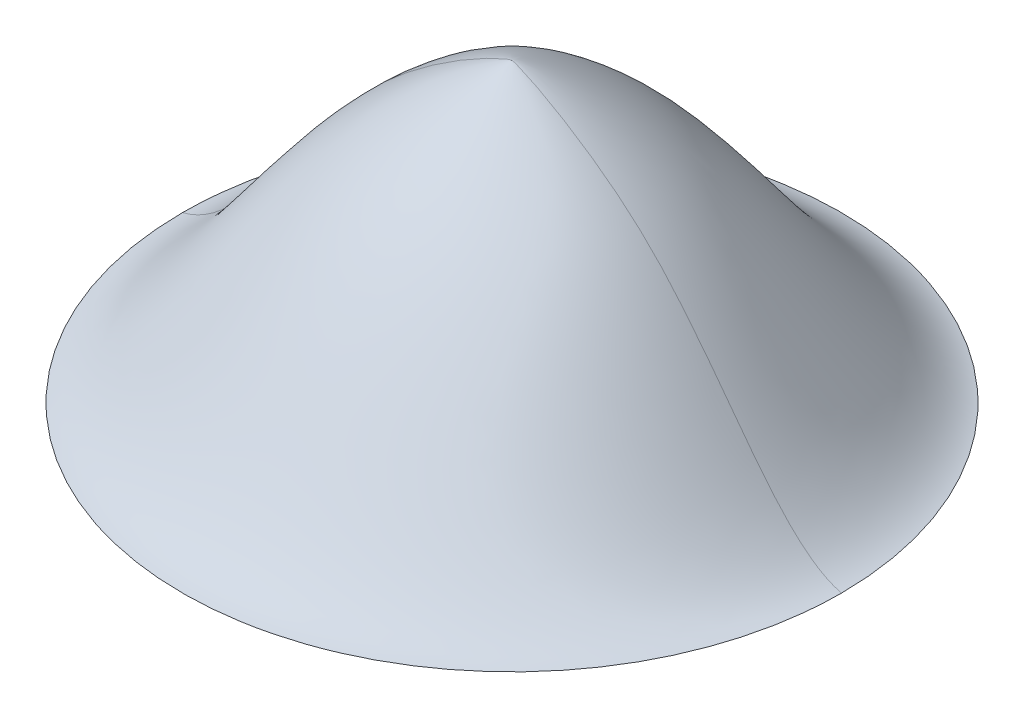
ISO-10303-21;
HEADER;
FILE_DESCRIPTION(('STEP AP214'),'2;1');
FILE_NAME('part.step','',(''),(''),'','','');
FILE_SCHEMA(('AUTOMOTIVE_DESIGN { 1 0 10303 214 1 1 1 1 }'));
ENDSEC;
DATA;
#1=APPLICATION_CONTEXT('core data for automotive mechanical design processes');
#2=APPLICATION_PROTOCOL_DEFINITION('international standard','automotive_design',2000,#1);
#3=PRODUCT_CONTEXT('',#1,'mechanical');
#4=PRODUCT('Part','Part','',(#3));
#5=PRODUCT_RELATED_PRODUCT_CATEGORY('part','',(#4));
#6=PRODUCT_DEFINITION_FORMATION('','',#4);
#7=PRODUCT_DEFINITION_CONTEXT('part definition',#1,'design');
#8=PRODUCT_DEFINITION('design','',#6,#7);
#9=PRODUCT_DEFINITION_SHAPE('','',#8);
#10=(LENGTH_UNIT() NAMED_UNIT(*) SI_UNIT(.MILLI.,.METRE.));
#11=(NAMED_UNIT(*) PLANE_ANGLE_UNIT() SI_UNIT($,.RADIAN.));
#12=(NAMED_UNIT(*) SI_UNIT($,.STERADIAN.) SOLID_ANGLE_UNIT());
#13=UNCERTAINTY_MEASURE_WITH_UNIT(LENGTH_MEASURE(1.E-05),#10,'distance_accuracy_value','');
#14=(GEOMETRIC_REPRESENTATION_CONTEXT(3) GLOBAL_UNCERTAINTY_ASSIGNED_CONTEXT((#13)) GLOBAL_UNIT_ASSIGNED_CONTEXT((#10,
#11,#12)) REPRESENTATION_CONTEXT('',''));
#15=CARTESIAN_POINT('',(0.,0.,0.));
#16=DIRECTION('',(0.,0.,1.));
#17=DIRECTION('',(1.,0.,0.));
#18=AXIS2_PLACEMENT_3D('',#15,#16,#17);
#19=CARTESIAN_POINT('',(-2.,0.,0.));
#20=CARTESIAN_POINT('',(-2.,0.,4.));
#21=CARTESIAN_POINT('',(2.,0.,4.));
#22=CARTESIAN_POINT('',(2.,0.,0.));
#23=CARTESIAN_POINT('',(-1.61118745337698,0.0939404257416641,0.));
#24=CARTESIAN_POINT('',(-1.61118745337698,0.0939404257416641,3.22237490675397));
#25=CARTESIAN_POINT('',(1.61118745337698,0.0939404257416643,3.22237490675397));
#26=CARTESIAN_POINT('',(1.61118745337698,0.0939404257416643,0.));
#27=CARTESIAN_POINT('',(-1.06164914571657,1.3113668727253,0.));
#28=CARTESIAN_POINT('',(-1.06164914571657,1.3113668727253,2.12329829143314));
#29=CARTESIAN_POINT('',(1.06164914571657,1.3113668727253,2.12329829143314));
#30=CARTESIAN_POINT('',(1.06164914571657,1.3113668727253,0.));
#31=CARTESIAN_POINT('',(-0.0421793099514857,1.8,0.));
#32=CARTESIAN_POINT('',(-0.0421793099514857,1.8,0.0843586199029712));
#33=CARTESIAN_POINT('',(0.0421793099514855,1.8,0.0843586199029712));
#34=CARTESIAN_POINT('',(0.0421793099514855,1.8,0.));
#35=CARTESIAN_POINT('',(0.,1.8,0.));
#36=CARTESIAN_POINT('',(0.,1.8,0.));
#37=CARTESIAN_POINT('',(0.,1.8,0.));
#38=CARTESIAN_POINT('',(0.,1.8,0.));
#39=(BOUNDED_SURFACE() B_SPLINE_SURFACE(3,3,((#19,#20,#21,#22),(#23,#24,#25,#26),(#27,#28,#29,
#30),(#31,#32,#33,#34),(#35,#36,#37,#38)),.UNSPECIFIED.,.F.,.F.,
.F.) B_SPLINE_SURFACE_WITH_KNOTS((4,1,4),(4,4),(0.,0.589485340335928,1.),(0.,1.),
.UNSPECIFIED.) GEOMETRIC_REPRESENTATION_ITEM() RATIONAL_B_SPLINE_SURFACE(((1.,0.333333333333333,
0.333333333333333,1.),(1.,0.333333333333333,0.333333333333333,1.),(1.,0.333333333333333,
0.333333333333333,1.),(1.,0.333333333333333,0.333333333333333,1.),(1.,0.333333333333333,
0.333333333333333,1.))) REPRESENTATION_ITEM('') SURFACE());
#40=CARTESIAN_POINT('',(-2.,0.,0.));
#41=CARTESIAN_POINT('',(-2.00000555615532,0.,0.0553011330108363));
#42=CARTESIAN_POINT('',(-1.99770654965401,0.,0.110601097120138));
#43=CARTESIAN_POINT('',(-1.98853137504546,0.,0.220921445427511));
#44=CARTESIAN_POINT('',(-1.98164689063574,0.,0.275941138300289));
#45=CARTESIAN_POINT('',(-1.96321385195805,0.,0.385930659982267));
#46=CARTESIAN_POINT('',(-1.95160578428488,0.,0.44089052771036));
#47=CARTESIAN_POINT('',(-1.92380855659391,0.,0.549646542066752));
#48=CARTESIAN_POINT('',(-1.90761873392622,0.,0.603442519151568));
#49=CARTESIAN_POINT('',(-1.87076149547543,0.,0.709509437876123));
#50=CARTESIAN_POINT('',(-1.85009205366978,0.,0.761779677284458));
#51=CARTESIAN_POINT('',(-1.80441836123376,0.,0.864428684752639));
#52=CARTESIAN_POINT('',(-1.77941041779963,0.,0.914805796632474));
#53=CARTESIAN_POINT('',(-1.69813109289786,0.,1.06252541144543));
#54=CARTESIAN_POINT('',(-1.63558652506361,0.,1.15650695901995));
#55=CARTESIAN_POINT('',(-1.49558805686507,0.,1.33261853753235));
#56=CARTESIAN_POINT('',(-1.41813372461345,0.,1.4147482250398));
#57=CARTESIAN_POINT('',(-1.29250560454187,0.,1.52728641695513));
#58=CARTESIAN_POINT('',(-1.24902259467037,0.,1.56304361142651));
#59=CARTESIAN_POINT('',(-1.15924585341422,0.,1.6307383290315));
#60=CARTESIAN_POINT('',(-1.11295486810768,0.,1.66267949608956));
#61=CARTESIAN_POINT('',(-0.9702522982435,0.,1.75248979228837));
#62=CARTESIAN_POINT('',(-0.869977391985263,0.,1.804375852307));
#63=CARTESIAN_POINT('',(-0.662192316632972,0.,1.89054714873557));
#64=CARTESIAN_POINT('',(-0.554682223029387,0.,1.9248325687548));
#65=CARTESIAN_POINT('',(-0.335417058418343,0.,1.97487553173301));
#66=CARTESIAN_POINT('',(-0.223661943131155,0.,1.99063288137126));
#67=CARTESIAN_POINT('',(0.000904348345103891,0.,2.00315968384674));
#68=CARTESIAN_POINT('',(0.113715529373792,0.,1.99992904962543));
#69=CARTESIAN_POINT('',(0.337193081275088,0.,1.97457487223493));
#70=CARTESIAN_POINT('',(0.447859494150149,0.,1.9524516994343));
#71=CARTESIAN_POINT('',(0.663906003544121,0.,1.88994045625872));
#72=CARTESIAN_POINT('',(0.769286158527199,0.,1.84955258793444));
#73=CARTESIAN_POINT('',(0.971774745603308,0.,1.75165650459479));
#74=CARTESIAN_POINT('',(1.06888283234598,0.,1.69414757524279));
#75=CARTESIAN_POINT('',(1.25206623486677,0.,1.56364238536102));
#76=CARTESIAN_POINT('',(1.33814145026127,0.,1.49064598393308));
#77=CARTESIAN_POINT('',(1.49681027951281,0.,1.3312414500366));
#78=CARTESIAN_POINT('',(1.56940470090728,0.,1.24483412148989));
#79=CARTESIAN_POINT('',(1.69906234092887,0.,1.06105468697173));
#80=CARTESIAN_POINT('',(1.7561239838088,0.,0.963681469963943));
#81=CARTESIAN_POINT('',(1.85308668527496,0.,0.76073099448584));
#82=CARTESIAN_POINT('',(1.89299019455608,0.,0.655154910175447));
#83=CARTESIAN_POINT('',(1.94900977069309,0.,0.458145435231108));
#84=CARTESIAN_POINT('',(1.9680973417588,0.,0.367543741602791));
#85=CARTESIAN_POINT('',(1.99360616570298,0.,0.184638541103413));
#86=CARTESIAN_POINT('',(2.00003601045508,0.,0.0923362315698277));
#87=CARTESIAN_POINT('',(2.,0.,0.));
#88=B_SPLINE_CURVE_WITH_KNOTS('',3,(#40,#41,#42,#43,#44,#45,#46,#47,#48,#49,#50,#51,#52,#53,#54,
#55,#56,#57,#58,#59,#60,#61,#62,#63,#64,#65,#66,#67,#68,#69,#70,#71,#72,#73,#74,#75,#76,#77,#78,
#79,#80,#81,#82,#83,#84,#85,#86,#87),.UNSPECIFIED.,.F.,.F.,(4,2,2,2,2,2,2,2,2,2,2,2,2,2,2,2,2,2,
2,2,2,2,2,4),(0.,0.165853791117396,0.332009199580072,0.500326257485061,0.668667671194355,
0.83708538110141,1.00564715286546,1.34261146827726,1.67958554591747,1.84830039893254,
2.01685283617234,2.35382379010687,2.69079122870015,3.0277621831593,3.3647346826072,
3.70170057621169,4.03866274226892,4.3756389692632,4.71261826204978,5.0495773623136,
5.38657063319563,5.72351575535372,6.00042685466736,6.27714992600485),.UNSPECIFIED.);
#89=CARTESIAN_POINT('',(-2.,0.,0.));
#90=VERTEX_POINT('',#89);
#91=CARTESIAN_POINT('',(2.,0.,0.));
#92=VERTEX_POINT('',#91);
#93=EDGE_CURVE('E23',#90,#92,#88,.T.);
#94=CARTESIAN_POINT('',(2.,0.,0.));
#95=CARTESIAN_POINT('',(1.61118745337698,0.0939404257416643,0.));
#96=CARTESIAN_POINT('',(1.06164914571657,1.3113668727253,0.));
#97=CARTESIAN_POINT('',(0.0421793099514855,1.8,0.));
#98=CARTESIAN_POINT('',(0.,1.8,0.));
#99=B_SPLINE_CURVE_WITH_KNOTS('',3,(#94,#95,#96,#97,#98),.UNSPECIFIED.,.F.,.F.,(4,1,4),(0.,
0.589485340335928,1.),.UNSPECIFIED.);
#100=CARTESIAN_POINT('',(0.,1.8,0.));
#101=VERTEX_POINT('',#100);
#102=EDGE_CURVE('E37',#92,#101,#99,.T.);
#103=CARTESIAN_POINT('',(-2.,0.,0.));
#104=CARTESIAN_POINT('',(-1.61118745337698,0.0939404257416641,0.));
#105=CARTESIAN_POINT('',(-1.06164914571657,1.3113668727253,0.));
#106=CARTESIAN_POINT('',(-0.0421793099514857,1.8,0.));
#107=CARTESIAN_POINT('',(0.,1.8,0.));
#108=B_SPLINE_CURVE_WITH_KNOTS('',3,(#103,#104,#105,#106,#107),.UNSPECIFIED.,.F.,.F.,(4,1,4),
(0.,0.589485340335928,1.),.UNSPECIFIED.);
#109=EDGE_CURVE('E45',#101,#90,#108,.F.);
#110=ORIENTED_EDGE('',*,*,#93,.T.);
#111=ORIENTED_EDGE('',*,*,#102,.T.);
#112=ORIENTED_EDGE('',*,*,#109,.T.);
#113=EDGE_LOOP('',(#110,#111,#112));
#114=FACE_BOUND('',#113,.T.);
#115=ADVANCED_FACE('F17',(#114),#39,.F.);
#116=CARTESIAN_POINT('',(2.,0.,0.));
#117=CARTESIAN_POINT('',(2.,0.,-4.));
#118=CARTESIAN_POINT('',(-2.,0.,-4.));
#119=CARTESIAN_POINT('',(-2.,0.,0.));
#120=CARTESIAN_POINT('',(1.61118745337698,0.0939404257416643,0.));
#121=CARTESIAN_POINT('',(1.61118745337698,0.0939404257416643,-3.22237490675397));
#122=CARTESIAN_POINT('',(-1.61118745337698,0.0939404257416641,-3.22237490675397));
#123=CARTESIAN_POINT('',(-1.61118745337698,0.0939404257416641,0.));
#124=CARTESIAN_POINT('',(1.06164914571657,1.3113668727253,0.));
#125=CARTESIAN_POINT('',(1.06164914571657,1.3113668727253,-2.12329829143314));
#126=CARTESIAN_POINT('',(-1.06164914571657,1.3113668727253,-2.12329829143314));
#127=CARTESIAN_POINT('',(-1.06164914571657,1.3113668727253,0.));
#128=CARTESIAN_POINT('',(0.0421793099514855,1.8,0.));
#129=CARTESIAN_POINT('',(0.0421793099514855,1.8,-0.0843586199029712));
#130=CARTESIAN_POINT('',(-0.0421793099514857,1.8,-0.0843586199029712));
#131=CARTESIAN_POINT('',(-0.0421793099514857,1.8,0.));
#132=CARTESIAN_POINT('',(0.,1.8,0.));
#133=CARTESIAN_POINT('',(0.,1.8,0.));
#134=CARTESIAN_POINT('',(0.,1.8,0.));
#135=CARTESIAN_POINT('',(0.,1.8,0.));
#136=(BOUNDED_SURFACE() B_SPLINE_SURFACE(3,3,((#116,#117,#118,#119),(#120,#121,#122,#123),(#124,
#125,#126,#127),(#128,#129,#130,#131),(#132,#133,#134,#135)),.UNSPECIFIED.,.F.,.F.,
.F.) B_SPLINE_SURFACE_WITH_KNOTS((4,1,4),(4,4),(0.,0.589485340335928,1.),(0.,1.),
.UNSPECIFIED.) GEOMETRIC_REPRESENTATION_ITEM() RATIONAL_B_SPLINE_SURFACE(((1.,0.333333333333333,
0.333333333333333,1.),(1.,0.333333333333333,0.333333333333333,1.),(1.,0.333333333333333,
0.333333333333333,1.),(1.,0.333333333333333,0.333333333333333,1.),(1.,0.333333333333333,
0.333333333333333,1.))) REPRESENTATION_ITEM('') SURFACE());
#137=CARTESIAN_POINT('',(2.,0.,0.));
#138=CARTESIAN_POINT('',(2.00000555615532,0.,-0.0553011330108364));
#139=CARTESIAN_POINT('',(1.997706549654,0.,-0.110601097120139));
#140=CARTESIAN_POINT('',(1.98853137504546,0.,-0.220921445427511));
#141=CARTESIAN_POINT('',(1.98164689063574,0.,-0.275941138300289));
#142=CARTESIAN_POINT('',(1.96321385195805,0.,-0.385930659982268));
#143=CARTESIAN_POINT('',(1.95160578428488,0.,-0.440890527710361));
#144=CARTESIAN_POINT('',(1.92380855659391,0.,-0.549646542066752));
#145=CARTESIAN_POINT('',(1.90761873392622,0.,-0.603442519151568));
#146=CARTESIAN_POINT('',(1.87076149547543,0.,-0.709509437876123));
#147=CARTESIAN_POINT('',(1.85009205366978,0.,-0.761779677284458));
#148=CARTESIAN_POINT('',(1.80441836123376,0.,-0.86442868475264));
#149=CARTESIAN_POINT('',(1.77941041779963,0.,-0.914805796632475));
#150=CARTESIAN_POINT('',(1.69813109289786,0.,-1.06252541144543));
#151=CARTESIAN_POINT('',(1.63558652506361,0.,-1.15650695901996));
#152=CARTESIAN_POINT('',(1.49558805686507,0.,-1.33261853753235));
#153=CARTESIAN_POINT('',(1.41813372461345,0.,-1.4147482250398));
#154=CARTESIAN_POINT('',(1.29250560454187,0.,-1.52728641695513));
#155=CARTESIAN_POINT('',(1.24902259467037,0.,-1.56304361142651));
#156=CARTESIAN_POINT('',(1.15924585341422,0.,-1.6307383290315));
#157=CARTESIAN_POINT('',(1.11295486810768,0.,-1.66267949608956));
#158=CARTESIAN_POINT('',(0.970252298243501,0.,-1.75248979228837));
#159=CARTESIAN_POINT('',(0.869977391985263,0.,-1.804375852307));
#160=CARTESIAN_POINT('',(0.662192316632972,0.,-1.89054714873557));
#161=CARTESIAN_POINT('',(0.554682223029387,0.,-1.9248325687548));
#162=CARTESIAN_POINT('',(0.335417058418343,0.,-1.97487553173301));
#163=CARTESIAN_POINT('',(0.223661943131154,0.,-1.99063288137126));
#164=CARTESIAN_POINT('',(-0.000904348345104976,0.,-2.00315968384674));
#165=CARTESIAN_POINT('',(-0.113715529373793,0.,-1.99992904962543));
#166=CARTESIAN_POINT('',(-0.337193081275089,0.,-1.97457487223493));
#167=CARTESIAN_POINT('',(-0.447859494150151,0.,-1.9524516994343));
#168=CARTESIAN_POINT('',(-0.663906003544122,0.,-1.88994045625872));
#169=CARTESIAN_POINT('',(-0.7692861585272,0.,-1.84955258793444));
#170=CARTESIAN_POINT('',(-0.971774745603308,0.,-1.75165650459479));
#171=CARTESIAN_POINT('',(-1.06888283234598,0.,-1.69414757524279));
#172=CARTESIAN_POINT('',(-1.25206623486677,0.,-1.56364238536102));
#173=CARTESIAN_POINT('',(-1.33814145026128,0.,-1.49064598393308));
#174=CARTESIAN_POINT('',(-1.49681027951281,0.,-1.3312414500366));
#175=CARTESIAN_POINT('',(-1.56940470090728,0.,-1.24483412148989));
#176=CARTESIAN_POINT('',(-1.69906234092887,0.,-1.06105468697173));
#177=CARTESIAN_POINT('',(-1.7561239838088,0.,-0.963681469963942));
#178=CARTESIAN_POINT('',(-1.85308668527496,0.,-0.760730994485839));
#179=CARTESIAN_POINT('',(-1.89299019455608,0.,-0.655154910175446));
#180=CARTESIAN_POINT('',(-1.94900977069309,0.,-0.458145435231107));
#181=CARTESIAN_POINT('',(-1.9680973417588,0.,-0.36754374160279));
#182=CARTESIAN_POINT('',(-1.99360616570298,0.,-0.184638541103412));
#183=CARTESIAN_POINT('',(-2.00003601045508,0.,-0.0923362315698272));
#184=CARTESIAN_POINT('',(-2.,0.,0.));
#185=B_SPLINE_CURVE_WITH_KNOTS('',3,(#137,#138,#139,#140,#141,#142,#143,#144,#145,#146,#147,
#148,#149,#150,#151,#152,#153,#154,#155,#156,#157,#158,#159,#160,#161,#162,#163,#164,#165,#166,
#167,#168,#169,#170,#171,#172,#173,#174,#175,#176,#177,#178,#179,#180,#181,#182,#183,#184),
.UNSPECIFIED.,.F.,.F.,(4,2,2,2,2,2,2,2,2,2,2,2,2,2,2,2,2,2,2,2,2,2,2,4),(0.,0.165853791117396,
0.332009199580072,0.500326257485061,0.668667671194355,0.83708538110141,1.00564715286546,
1.34261146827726,1.67958554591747,1.84830039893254,2.01685283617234,2.35382379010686,
2.69079122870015,3.0277621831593,3.3647346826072,3.70170057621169,4.03866274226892,
4.3756389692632,4.71261826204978,5.0495773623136,5.38657063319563,5.72351575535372,
6.00042685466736,6.27714992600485),.UNSPECIFIED.);
#186=EDGE_CURVE('E11',#92,#90,#185,.T.);
#187=ORIENTED_EDGE('',*,*,#109,.F.);
#188=ORIENTED_EDGE('',*,*,#102,.F.);
#189=ORIENTED_EDGE('',*,*,#186,.T.);
#190=EDGE_LOOP('',(#187,#188,#189));
#191=FACE_BOUND('',#190,.T.);
#192=ADVANCED_FACE('F46',(#191),#136,.F.);
#193=CARTESIAN_POINT('',(0.,0.,0.));
#194=DIRECTION('',(0.,1.,0.));
#195=DIRECTION('',(-1.,0.,0.));
#196=AXIS2_PLACEMENT_3D('',#193,#194,#195);
#197=PLANE('',#196);
#198=ORIENTED_EDGE('',*,*,#93,.F.);
#199=ORIENTED_EDGE('',*,*,#186,.F.);
#200=EDGE_LOOP('',(#198,#199));
#201=FACE_BOUND('',#200,.T.);
#202=ADVANCED_FACE('F67',(#201),#197,.F.);
#203=CLOSED_SHELL('',(#115,#192,#202));
#204=MANIFOLD_SOLID_BREP('B1',#203);
#205=ADVANCED_BREP_SHAPE_REPRESENTATION('',(#18,#204),#14);
#206=SHAPE_DEFINITION_REPRESENTATION(#9,#205);
ENDSEC;
END-ISO-10303-21;
